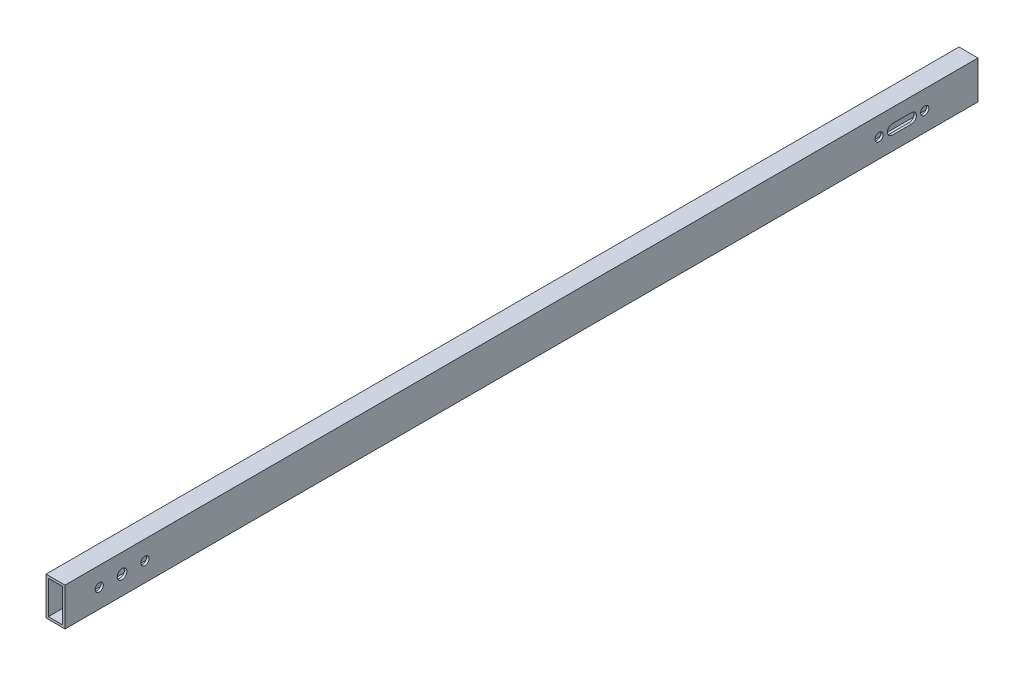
from build123d import *

# Parameters (mm, degrees)
SKETCH1_W           = 12.7
SKETCH1_H           = 25.4
SKETCH1_W_2         = 9.525
SKETCH1_H_2         = 22.225
BOSS_EXTRUDE1_DEPTH = 609.6
SKETCH2_R           = 3.25
SKETCH2_R_2         = 2.75
CUT_EXTRUDE1_DEPTH  = 610.86452594
CUT_EXTRUDE3_REACH  = 611.865
CUT_EXTRUDE5_REACH  = 612.162
SKETCH5_R           = 2.75


with BuildPart() as part:
    # Sketch1 → Boss-Extrude1 (new body)
    with BuildSketch(Plane.XY):
        Rectangle(SKETCH1_W, SKETCH1_H)
        Rectangle(SKETCH1_W_2, SKETCH1_H_2, mode=Mode.SUBTRACT)
    extrude(amount=BOSS_EXTRUDE1_DEPTH)

    # Sketch2 → Cut-Extrude1 (cut, through all)
    with BuildSketch(Plane(origin=(6.35, 0, 0), x_dir=(0, 0, -1), z_dir=(1, 0, 0))):
        with Locations((-571.5, 0)):
            Circle(SKETCH2_R)
        with Locations((-586.74, 0)):
            Circle(SKETCH2_R_2)
        with Locations((-556.26, 0)):
            Circle(SKETCH2_R_2)
        with Locations((-66.04, 0)):
            Circle(SKETCH2_R_2)
        with Locations((-35.56, 0)):
            Circle(SKETCH2_R_2)
        with BuildLine():
            Line((-44.45, -3.302), (-57.15, -3.302))
            ThreePointArc((-57.15, -3.302), (-60.452, 0), (-57.15, 3.302))
            Line((-57.15, 3.302), (-44.45, 3.302))
            ThreePointArc((-44.45, 3.302), (-41.148, 0), (-44.45, -3.302))
        make_face()
    extrude(amount=-CUT_EXTRUDE1_DEPTH, mode=Mode.SUBTRACT)

    # Sketch4 → Cut-Extrude3 (cut, up to next)
    with BuildSketch(Plane.ZY.offset(6.35), mode=Mode.PRIVATE) as cut_extrude3_sk1:
        with BuildLine():
            Line((35.56, 5), (66.04, 5))
            ThreePointArc((66.04, 5), (71.04, 0), (66.04, -5))
            Line((66.04, -5), (35.56, -5))
            ThreePointArc((35.56, -5), (30.56, 0), (35.56, 5))
        make_face()
    cut_extrude3_tool1 = extrude(cut_extrude3_sk1.sketch, amount=-CUT_EXTRUDE3_REACH, mode=Mode.PRIVATE) & part.part
    # Sketch4 → Cut-Extrude3 (cut, up to next)
    with BuildSketch(Plane.ZY.offset(6.35), mode=Mode.PRIVATE) as cut_extrude3_sk2:
        with BuildLine():
            Line((556.26, 5), (586.74, 5))
            ThreePointArc((586.74, 5), (591.74, 0), (586.74, -5))
            Line((586.74, -5), (556.26, -5))
            ThreePointArc((556.26, -5), (551.26, 0), (556.26, 5))
        make_face()
    cut_extrude3_tool2 = extrude(cut_extrude3_sk2.sketch, amount=-CUT_EXTRUDE3_REACH, mode=Mode.PRIVATE) & part.part
    add(cut_extrude3_tool1.solids().sort_by_distance((-6.35, 0, 50.8))[0], mode=Mode.SUBTRACT)
    add(cut_extrude3_tool2.solids().sort_by_distance((-6.35, 0, 571.5))[0], mode=Mode.SUBTRACT)

    # Sketch5 → Cut-Extrude5 (cut, up to next)
    with BuildSketch(Plane.XZ.offset(12.7), mode=Mode.PRIVATE) as cut_extrude5_sk1:
        with Locations(Location((0, 596.9, 0), (0, 0, 270))):
            Circle(SKETCH5_R)
    cut_extrude5_tool1 = extrude(cut_extrude5_sk1.sketch, amount=-CUT_EXTRUDE5_REACH, mode=Mode.PRIVATE) & part.part
    # Sketch5 → Cut-Extrude5 (cut, up to next)
    with BuildSketch(Plane.XZ.offset(12.7), mode=Mode.PRIVATE) as cut_extrude5_sk2:
        with Locations(Location((0, 12.7, 0), (0, 0, 270))):
            Circle(SKETCH5_R)
    cut_extrude5_tool2 = extrude(cut_extrude5_sk2.sketch, amount=-CUT_EXTRUDE5_REACH, mode=Mode.PRIVATE) & part.part
    add(cut_extrude5_tool1.solids().sort_by_distance((0, -12.7, 596.9))[0], mode=Mode.SUBTRACT)
    add(cut_extrude5_tool2.solids().sort_by_distance((0, -12.7, 12.7))[0], mode=Mode.SUBTRACT)


solid = part.part
